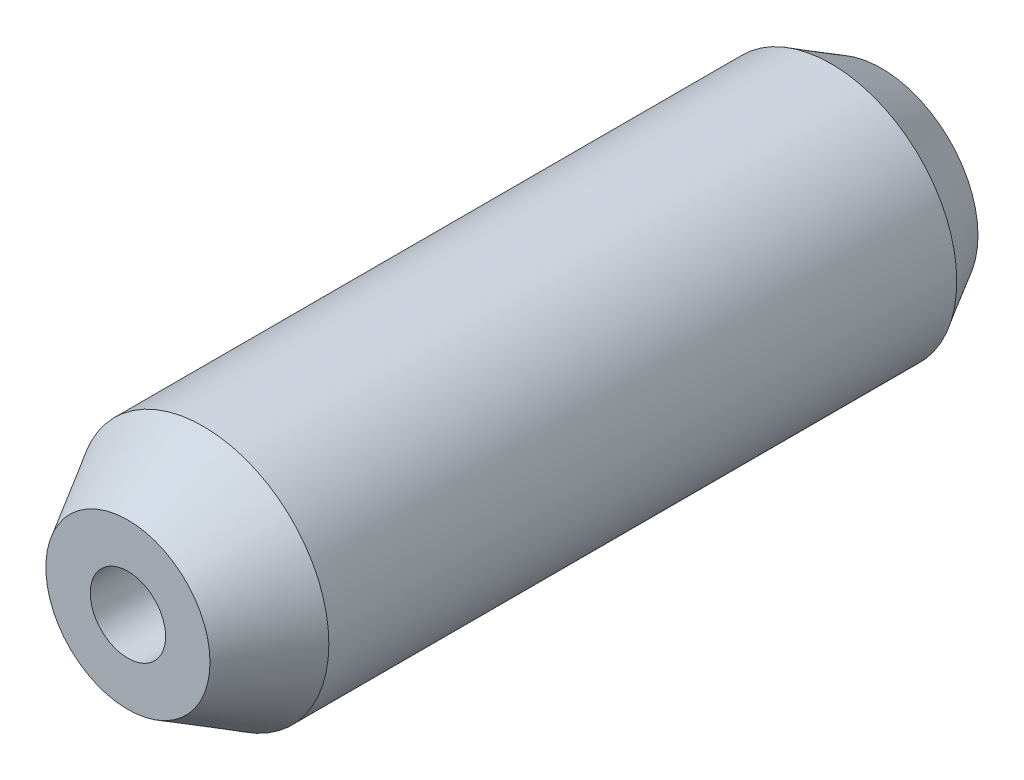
ISO-10303-21;
HEADER;
FILE_DESCRIPTION(('STEP AP214'),'2;1');
FILE_NAME('part.step','',(''),(''),'','','');
FILE_SCHEMA(('AUTOMOTIVE_DESIGN { 1 0 10303 214 1 1 1 1 }'));
ENDSEC;
DATA;
#1=APPLICATION_CONTEXT('core data for automotive mechanical design processes');
#2=APPLICATION_PROTOCOL_DEFINITION('international standard','automotive_design',2000,#1);
#3=PRODUCT_CONTEXT('',#1,'mechanical');
#4=PRODUCT('Part','Part','',(#3));
#5=PRODUCT_RELATED_PRODUCT_CATEGORY('part','',(#4));
#6=PRODUCT_DEFINITION_FORMATION('','',#4);
#7=PRODUCT_DEFINITION_CONTEXT('part definition',#1,'design');
#8=PRODUCT_DEFINITION('design','',#6,#7);
#9=PRODUCT_DEFINITION_SHAPE('','',#8);
#10=(LENGTH_UNIT() NAMED_UNIT(*) SI_UNIT(.MILLI.,.METRE.));
#11=(NAMED_UNIT(*) PLANE_ANGLE_UNIT() SI_UNIT($,.RADIAN.));
#12=(NAMED_UNIT(*) SI_UNIT($,.STERADIAN.) SOLID_ANGLE_UNIT());
#13=UNCERTAINTY_MEASURE_WITH_UNIT(LENGTH_MEASURE(1.E-05),#10,'distance_accuracy_value','');
#14=(GEOMETRIC_REPRESENTATION_CONTEXT(3) GLOBAL_UNCERTAINTY_ASSIGNED_CONTEXT((#13)) GLOBAL_UNIT_ASSIGNED_CONTEXT((#10,
#11,#12)) REPRESENTATION_CONTEXT('',''));
#15=CARTESIAN_POINT('',(0.,0.,0.));
#16=DIRECTION('',(0.,0.,1.));
#17=DIRECTION('',(1.,0.,0.));
#18=AXIS2_PLACEMENT_3D('',#15,#16,#17);
#19=CARTESIAN_POINT('',(0.,0.,0.));
#20=DIRECTION('',(0.,0.,1.));
#21=DIRECTION('',(1.,0.,0.));
#22=AXIS2_PLACEMENT_3D('',#19,#20,#21);
#23=PLANE('',#22);
#24=CARTESIAN_POINT('',(0.,0.,0.));
#25=DIRECTION('',(0.,0.,1.));
#26=DIRECTION('',(1.,0.,0.));
#27=AXIS2_PLACEMENT_3D('',#24,#25,#26);
#28=CIRCLE('',#27,3.84529946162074);
#29=CARTESIAN_POINT('',(3.84529946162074,0.,0.));
#30=VERTEX_POINT('',#29);
#31=EDGE_CURVE('E8',#30,#30,#28,.T.);
#32=ORIENTED_EDGE('',*,*,#31,.F.);
#33=EDGE_LOOP('',(#32));
#34=FACE_BOUND('',#33,.T.);
#35=ADVANCED_FACE('F13',(#34),#23,.F.);
#36=CARTESIAN_POINT('',(0.,0.,2.));
#37=DIRECTION('',(0.,0.,1.));
#38=DIRECTION('',(1.,0.,0.));
#39=AXIS2_PLACEMENT_3D('',#36,#37,#38);
#40=CONICAL_SURFACE('',#39,5.,0.523598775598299);
#41=ORIENTED_EDGE('',*,*,#31,.T.);
#42=EDGE_LOOP('',(#41));
#43=FACE_BOUND('',#42,.T.);
#44=CARTESIAN_POINT('',(0.,0.,2.));
#45=DIRECTION('',(0.,0.,1.));
#46=DIRECTION('',(1.,0.,0.));
#47=AXIS2_PLACEMENT_3D('',#44,#45,#46);
#48=CIRCLE('',#47,5.);
#49=CARTESIAN_POINT('',(5.,0.,1.99999999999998));
#50=VERTEX_POINT('',#49);
#51=EDGE_CURVE('E19',#50,#50,#48,.T.);
#52=ORIENTED_EDGE('',*,*,#51,.F.);
#53=EDGE_LOOP('',(#52));
#54=FACE_BOUND('',#53,.T.);
#55=ADVANCED_FACE('F61',(#43,#54),#40,.T.);
#56=CARTESIAN_POINT('',(-2.22044604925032E-13,0.,50.));
#57=DIRECTION('',(0.,0.,1.));
#58=DIRECTION('',(1.,0.,0.));
#59=AXIS2_PLACEMENT_3D('',#56,#57,#58);
#60=CYLINDRICAL_SURFACE('',#59,5.);
#61=CARTESIAN_POINT('',(0.,0.,27.));
#62=DIRECTION('',(0.,0.,1.));
#63=DIRECTION('',(1.,0.,0.));
#64=AXIS2_PLACEMENT_3D('',#61,#62,#63);
#65=CIRCLE('',#64,5.);
#66=CARTESIAN_POINT('',(4.99999999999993,0.,27.));
#67=VERTEX_POINT('',#66);
#68=EDGE_CURVE('E23',#67,#67,#65,.T.);
#69=ORIENTED_EDGE('',*,*,#68,.F.);
#70=EDGE_LOOP('',(#69));
#71=FACE_BOUND('',#70,.T.);
#72=ORIENTED_EDGE('',*,*,#51,.T.);
#73=EDGE_LOOP('',(#72));
#74=FACE_BOUND('',#73,.T.);
#75=ADVANCED_FACE('F56',(#71,#74),#60,.T.);
#76=CARTESIAN_POINT('',(0.,0.,27.));
#77=DIRECTION('',(0.,0.,-1.));
#78=DIRECTION('',(-1.,0.,0.));
#79=AXIS2_PLACEMENT_3D('',#76,#77,#78);
#80=CONICAL_SURFACE('',#79,5.,0.523598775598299);
#81=CARTESIAN_POINT('',(-1.2490009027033E-13,0.,30.));
#82=DIRECTION('',(0.,0.,1.));
#83=DIRECTION('',(1.,0.,0.));
#84=AXIS2_PLACEMENT_3D('',#81,#82,#83);
#85=CIRCLE('',#84,3.26794919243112);
#86=CARTESIAN_POINT('',(3.26794919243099,0.,30.));
#87=VERTEX_POINT('',#86);
#88=EDGE_CURVE('E27',#87,#87,#85,.T.);
#89=ORIENTED_EDGE('',*,*,#88,.F.);
#90=EDGE_LOOP('',(#89));
#91=FACE_BOUND('',#90,.T.);
#92=ORIENTED_EDGE('',*,*,#68,.T.);
#93=EDGE_LOOP('',(#92));
#94=FACE_BOUND('',#93,.T.);
#95=ADVANCED_FACE('F50',(#91,#94),#80,.T.);
#96=CARTESIAN_POINT('',(3.26794919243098,0.,30.));
#97=DIRECTION('',(0.,0.,-1.));
#98=DIRECTION('',(-1.,0.,0.));
#99=AXIS2_PLACEMENT_3D('',#96,#97,#98);
#100=PLANE('',#99);
#101=CARTESIAN_POINT('',(-1.2490009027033E-13,0.,30.));
#102=DIRECTION('',(0.,0.,1.));
#103=DIRECTION('',(1.,0.,0.));
#104=AXIS2_PLACEMENT_3D('',#101,#102,#103);
#105=CIRCLE('',#104,1.5);
#106=CARTESIAN_POINT('',(1.49999999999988,0.,30.));
#107=VERTEX_POINT('',#106);
#108=EDGE_CURVE('E32',#107,#107,#105,.T.);
#109=ORIENTED_EDGE('',*,*,#108,.F.);
#110=EDGE_LOOP('',(#109));
#111=FACE_BOUND('',#110,.T.);
#112=ORIENTED_EDGE('',*,*,#88,.T.);
#113=EDGE_LOOP('',(#112));
#114=FACE_BOUND('',#113,.T.);
#115=ADVANCED_FACE('F44',(#111,#114),#100,.F.);
#116=CARTESIAN_POINT('',(-2.22044604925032E-13,0.,50.));
#117=DIRECTION('',(0.,0.,1.));
#118=DIRECTION('',(1.,0.,0.));
#119=AXIS2_PLACEMENT_3D('',#116,#117,#118);
#120=CYLINDRICAL_SURFACE('',#119,1.5);
#121=CARTESIAN_POINT('',(0.,0.,24.));
#122=DIRECTION('',(0.,0.,1.));
#123=DIRECTION('',(1.,0.,0.));
#124=AXIS2_PLACEMENT_3D('',#121,#122,#123);
#125=CIRCLE('',#124,1.5);
#126=CARTESIAN_POINT('',(1.49999999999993,0.,24.));
#127=VERTEX_POINT('',#126);
#128=EDGE_CURVE('E35',#127,#127,#125,.T.);
#129=ORIENTED_EDGE('',*,*,#128,.F.);
#130=EDGE_LOOP('',(#129));
#131=FACE_BOUND('',#130,.T.);
#132=ORIENTED_EDGE('',*,*,#108,.T.);
#133=EDGE_LOOP('',(#132));
#134=FACE_BOUND('',#133,.T.);
#135=ADVANCED_FACE('F41',(#131,#134),#120,.F.);
#136=CARTESIAN_POINT('',(0.,0.,24.));
#137=DIRECTION('',(0.,0.,1.));
#138=DIRECTION('',(1.,0.,0.));
#139=AXIS2_PLACEMENT_3D('',#136,#137,#138);
#140=PLANE('',#139);
#141=ORIENTED_EDGE('',*,*,#128,.T.);
#142=EDGE_LOOP('',(#141));
#143=FACE_BOUND('',#142,.T.);
#144=ADVANCED_FACE('F39',(#143),#140,.T.);
#145=CLOSED_SHELL('',(#35,#55,#75,#95,#115,#135,#144));
#146=MANIFOLD_SOLID_BREP('B1',#145);
#147=ADVANCED_BREP_SHAPE_REPRESENTATION('',(#18,#146),#14);
#148=SHAPE_DEFINITION_REPRESENTATION(#9,#147);
ENDSEC;
END-ISO-10303-21;
